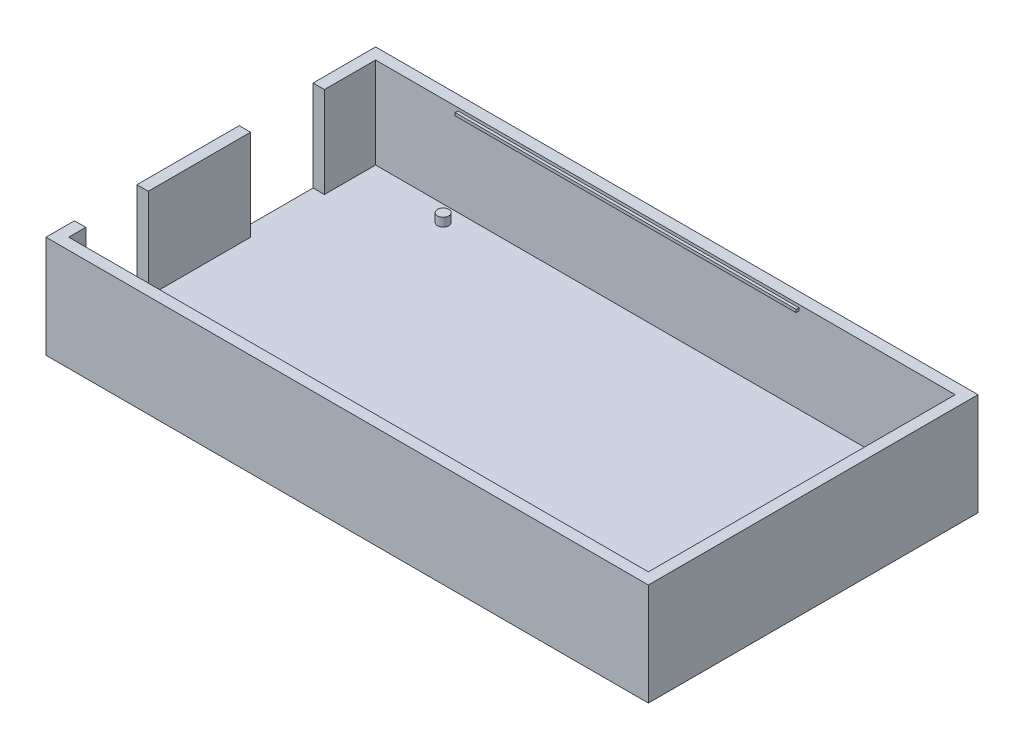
from build123d import *

# Parameters (mm, degrees)
CROQUIS1_W               = 106
CROQUIS1_H               = 58
SALIENTE_EXTRUIR1_DEPTH  = 18
VACIADO1_T               = -2
CORTAR_EXTRUIR1_REACH    = 124.164
CROQUIS9_W               = 13
CROQUIS9_H               = 16
CROQUIS9_W_2             = 11
CROQUIS10_W              = 60
CROQUIS10_H              = 0.5
SALIENTE_EXTRUIR10_DEPTH = 0.5
CROQUIS11_W              = 60
CROQUIS11_H              = 0.5
SALIENTE_EXTRUIR11_DEPTH = 0.5
CROQUIS14_R              = 1
SALIENTE_EXTRUIR12_DEPTH = 1.5


with BuildPart() as part:
    # Croquis1 → Saliente-Extruir1 (new body)
    with BuildSketch(Plane(origin=(0, 0, 0), x_dir=(1, 0, 0), z_dir=(0, 1, 0))):
        with Locations((53, 29)):
            Rectangle(CROQUIS1_W, CROQUIS1_H)
    extrude(amount=SALIENTE_EXTRUIR1_DEPTH)

    # Vaciado1
    vaciado1_openings = [part.faces().sort_by_distance(p)[0] for p in [
        (53, 18, -29),
    ]]
    offset(amount=VACIADO1_T, openings=vaciado1_openings, kind=Kind.INTERSECTION)

    # Croquis9 → Cortar-Extruir1 (cut, up to next)
    with BuildSketch(Plane.ZY, mode=Mode.PRIVATE) as cortar_extruir1_sk1:
        with Locations((-40.5, 10)):
            Rectangle(CROQUIS9_W, CROQUIS9_H)
    cortar_extruir1_tool1 = extrude(cortar_extruir1_sk1.sketch, amount=-CORTAR_EXTRUIR1_REACH, mode=Mode.PRIVATE) & part.part
    # Croquis9 → Cortar-Extruir1 (cut, up to next)
    with BuildSketch(Plane.ZY, mode=Mode.PRIVATE) as cortar_extruir1_sk2:
        with Locations((-10.5, 10)):
            Rectangle(CROQUIS9_W_2, CROQUIS9_H)
    cortar_extruir1_tool2 = extrude(cortar_extruir1_sk2.sketch, amount=-CORTAR_EXTRUIR1_REACH, mode=Mode.PRIVATE) & part.part
    add(cortar_extruir1_tool1.solids().sort_by_distance((0, 10, -40.5))[0], mode=Mode.SUBTRACT)
    add(cortar_extruir1_tool2.solids().sort_by_distance((0, 10, -10.5))[0], mode=Mode.SUBTRACT)

    # Croquis10 → Saliente-Extruir10 (add)
    with BuildSketch(Plane.XY.offset(-56)):
        with Locations((46.5, 17.25)):
            Rectangle(CROQUIS10_W, CROQUIS10_H)
    extrude(amount=SALIENTE_EXTRUIR10_DEPTH)

    # Croquis11 → Saliente-Extruir11 (add)
    with BuildSketch(Plane(origin=(0, 0, -2), x_dir=(-1, 0, 0), z_dir=(0, 0, -1))):
        with Locations((-59.5, 17.25)):
            Rectangle(CROQUIS11_W, CROQUIS11_H)
    extrude(amount=SALIENTE_EXTRUIR11_DEPTH)

    # Croquis14 → Saliente-Extruir12 (add)
    with BuildSketch(Plane(origin=(0, 2, 0), x_dir=(1, 0, 0), z_dir=(0, 1, 0))):
        with Locations(Location((16.699935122, 53.187578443, 0), (0, 0, 90))):
            Circle(CROQUIS14_R)
        with Locations(Location((91.629935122, 53.187578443, 0), (0, 0, 90))):
            Circle(CROQUIS14_R)
        with Locations(Location((97.979935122, 4.927578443, 0), (0, 0, 90))):
            Circle(CROQUIS14_R)
        with Locations(Location((15.429935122, 4.927578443, 0), (0, 0, 90))):
            Circle(CROQUIS14_R)
    extrude(amount=SALIENTE_EXTRUIR12_DEPTH)


solid = part.part
